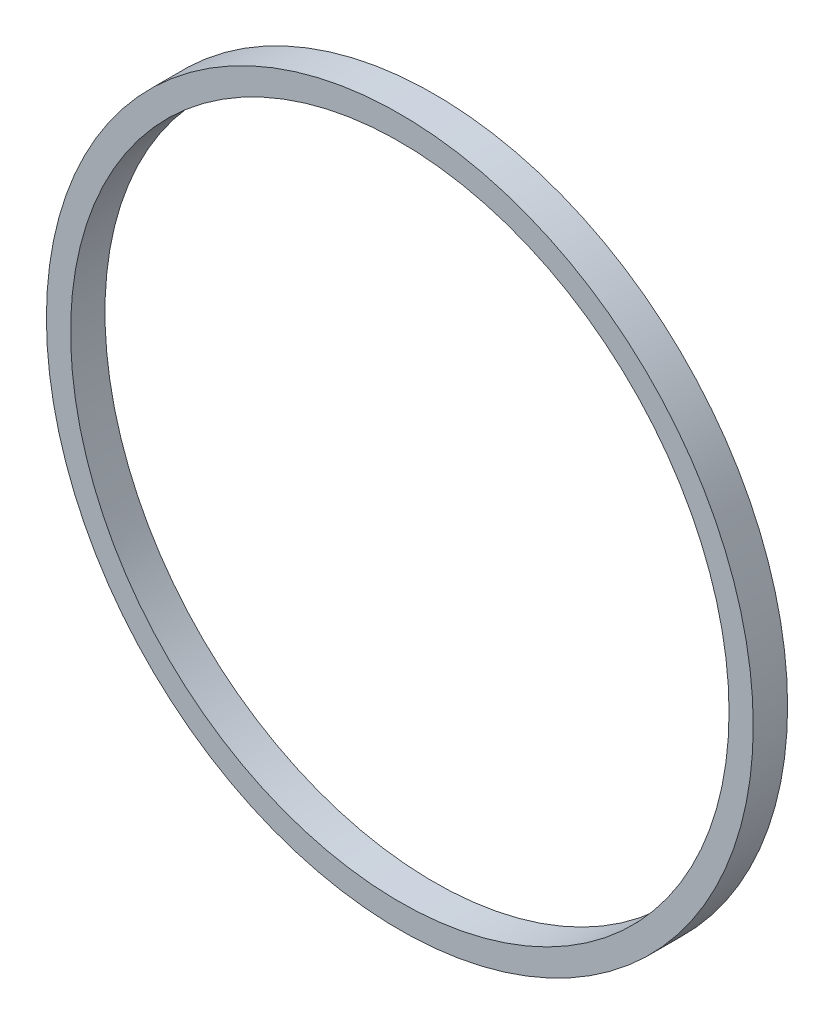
from build123d import *

# Parameters (mm, degrees)
SKETCH2_R           = 12.345
SKETCH2_R_2         = 11.5
BOSS_EXTRUDE1_DEPTH = 1.2


with BuildPart() as part:
    # Sketch2 → Boss-Extrude1 (new body)
    with BuildSketch(Plane.XY):
        Circle(SKETCH2_R)
        Circle(SKETCH2_R_2, mode=Mode.SUBTRACT)
    extrude(amount=BOSS_EXTRUDE1_DEPTH)


solid = part.part
